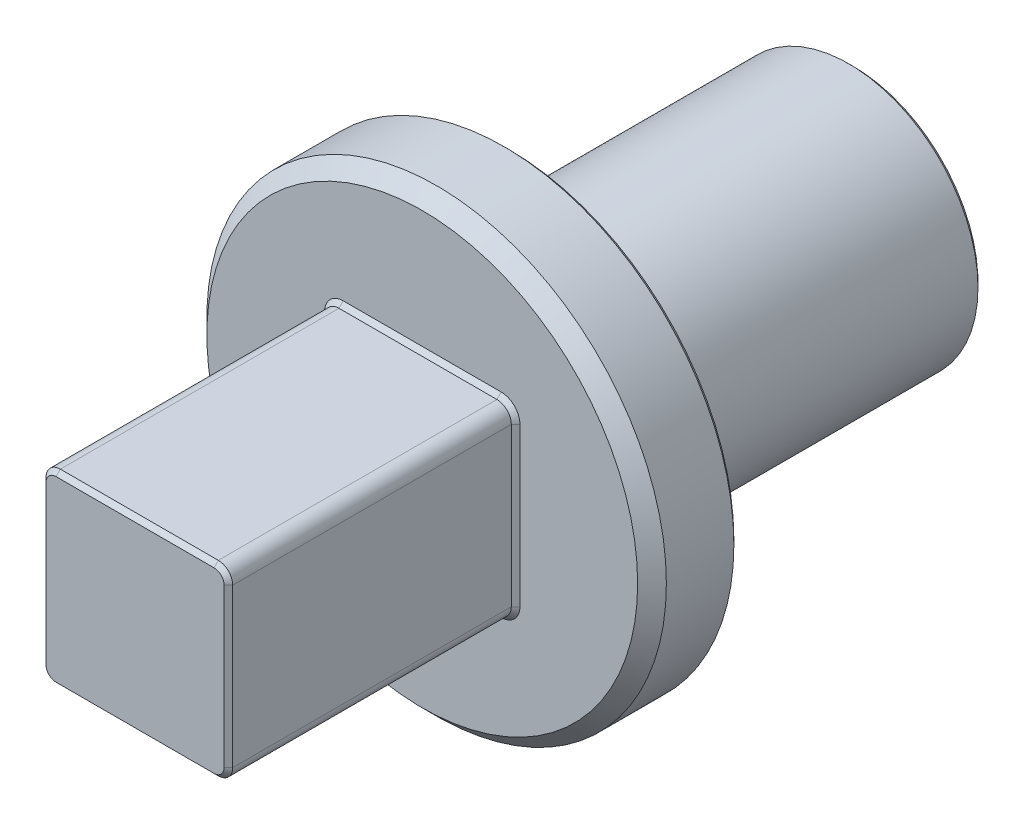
ISO-10303-21;
HEADER;
FILE_DESCRIPTION(('STEP AP214'),'2;1');
FILE_NAME('part.step','',(''),(''),'','','');
FILE_SCHEMA(('AUTOMOTIVE_DESIGN { 1 0 10303 214 1 1 1 1 }'));
ENDSEC;
DATA;
#1=APPLICATION_CONTEXT('core data for automotive mechanical design processes');
#2=APPLICATION_PROTOCOL_DEFINITION('international standard','automotive_design',2000,#1);
#3=PRODUCT_CONTEXT('',#1,'mechanical');
#4=PRODUCT('Part','Part','',(#3));
#5=PRODUCT_RELATED_PRODUCT_CATEGORY('part','',(#4));
#6=PRODUCT_DEFINITION_FORMATION('','',#4);
#7=PRODUCT_DEFINITION_CONTEXT('part definition',#1,'design');
#8=PRODUCT_DEFINITION('design','',#6,#7);
#9=PRODUCT_DEFINITION_SHAPE('','',#8);
#10=(LENGTH_UNIT() NAMED_UNIT(*) SI_UNIT(.MILLI.,.METRE.));
#11=(NAMED_UNIT(*) PLANE_ANGLE_UNIT() SI_UNIT($,.RADIAN.));
#12=(NAMED_UNIT(*) SI_UNIT($,.STERADIAN.) SOLID_ANGLE_UNIT());
#13=UNCERTAINTY_MEASURE_WITH_UNIT(LENGTH_MEASURE(1.E-05),#10,'distance_accuracy_value','');
#14=(GEOMETRIC_REPRESENTATION_CONTEXT(3) GLOBAL_UNCERTAINTY_ASSIGNED_CONTEXT((#13)) GLOBAL_UNIT_ASSIGNED_CONTEXT((#10,
#11,#12)) REPRESENTATION_CONTEXT('',''));
#15=CARTESIAN_POINT('',(0.,0.,0.));
#16=DIRECTION('',(0.,0.,1.));
#17=DIRECTION('',(1.,0.,0.));
#18=AXIS2_PLACEMENT_3D('',#15,#16,#17);
#19=CARTESIAN_POINT('',(0.,0.,0.));
#20=DIRECTION('',(0.,0.,1.));
#21=DIRECTION('',(1.,0.,0.));
#22=AXIS2_PLACEMENT_3D('',#19,#20,#21);
#23=PLANE('',#22);
#24=CARTESIAN_POINT('',(0.,0.,0.));
#25=DIRECTION('',(0.,0.,1.));
#26=DIRECTION('',(1.,0.,0.));
#27=AXIS2_PLACEMENT_3D('',#24,#25,#26);
#28=CIRCLE('',#27,4.65);
#29=CARTESIAN_POINT('',(4.65,0.,0.));
#30=VERTEX_POINT('',#29);
#31=EDGE_CURVE('E220',#30,#30,#28,.T.);
#32=ORIENTED_EDGE('',*,*,#31,.T.);
#33=EDGE_LOOP('',(#32));
#34=FACE_BOUND('',#33,.T.);
#35=CARTESIAN_POINT('',(0.,0.,0.));
#36=DIRECTION('',(0.,0.,1.));
#37=DIRECTION('',(1.,0.,0.));
#38=AXIS2_PLACEMENT_3D('',#35,#36,#37);
#39=CIRCLE('',#38,7.85);
#40=CARTESIAN_POINT('',(7.85,0.,0.));
#41=VERTEX_POINT('',#40);
#42=EDGE_CURVE('E217',#41,#41,#39,.F.);
#43=ORIENTED_EDGE('',*,*,#42,.T.);
#44=EDGE_LOOP('',(#43));
#45=FACE_BOUND('',#44,.T.);
#46=ADVANCED_FACE('F31',(#34,#45),#23,.F.);
#47=CARTESIAN_POINT('',(0.,0.,3.));
#48=DIRECTION('',(0.,0.,1.));
#49=DIRECTION('',(1.,0.,0.));
#50=AXIS2_PLACEMENT_3D('',#47,#48,#49);
#51=PLANE('',#50);
#52=CARTESIAN_POINT('',(-2.75,-2.75,3.));
#53=DIRECTION('',(0.,0.,1.));
#54=DIRECTION('',(1.,0.,0.));
#55=AXIS2_PLACEMENT_3D('',#52,#53,#54);
#56=CIRCLE('',#55,0.65);
#57=CARTESIAN_POINT('',(-2.75,-3.4,3.));
#58=VERTEX_POINT('',#57);
#59=CARTESIAN_POINT('',(-3.4,-2.75,3.));
#60=VERTEX_POINT('',#59);
#61=EDGE_CURVE('E48',#58,#60,#56,.F.);
#62=ORIENTED_EDGE('',*,*,#61,.T.);
#63=DIRECTION('',(0.,1.,0.));
#64=VECTOR('',#63,1.);
#65=CARTESIAN_POINT('',(-3.4,0.,3.));
#66=LINE('',#65,#64);
#67=CARTESIAN_POINT('',(-3.4,2.75,3.));
#68=VERTEX_POINT('',#67);
#69=EDGE_CURVE('E40',#60,#68,#66,.T.);
#70=ORIENTED_EDGE('',*,*,#69,.T.);
#71=CARTESIAN_POINT('',(-2.75,2.75,3.));
#72=DIRECTION('',(0.,0.,1.));
#73=DIRECTION('',(1.,0.,0.));
#74=AXIS2_PLACEMENT_3D('',#71,#72,#73);
#75=CIRCLE('',#74,0.65);
#76=CARTESIAN_POINT('',(-2.75,3.4,3.));
#77=VERTEX_POINT('',#76);
#78=EDGE_CURVE('E236',#68,#77,#75,.F.);
#79=ORIENTED_EDGE('',*,*,#78,.T.);
#80=DIRECTION('',(1.,0.,0.));
#81=VECTOR('',#80,1.);
#82=CARTESIAN_POINT('',(0.,3.4,3.));
#83=LINE('',#82,#81);
#84=CARTESIAN_POINT('',(2.75,3.4,3.));
#85=VERTEX_POINT('',#84);
#86=EDGE_CURVE('E232',#77,#85,#83,.T.);
#87=ORIENTED_EDGE('',*,*,#86,.T.);
#88=CARTESIAN_POINT('',(2.75,2.75,3.));
#89=DIRECTION('',(0.,0.,1.));
#90=DIRECTION('',(1.,0.,0.));
#91=AXIS2_PLACEMENT_3D('',#88,#89,#90);
#92=CIRCLE('',#91,0.65);
#93=CARTESIAN_POINT('',(3.4,2.75,3.));
#94=VERTEX_POINT('',#93);
#95=EDGE_CURVE('E228',#85,#94,#92,.F.);
#96=ORIENTED_EDGE('',*,*,#95,.T.);
#97=DIRECTION('',(0.,-1.,0.));
#98=VECTOR('',#97,1.);
#99=CARTESIAN_POINT('',(3.4,0.,3.));
#100=LINE('',#99,#98);
#101=CARTESIAN_POINT('',(3.4,-2.75,3.));
#102=VERTEX_POINT('',#101);
#103=EDGE_CURVE('E226',#94,#102,#100,.T.);
#104=ORIENTED_EDGE('',*,*,#103,.T.);
#105=CARTESIAN_POINT('',(2.75,-2.75,3.));
#106=DIRECTION('',(0.,0.,1.));
#107=DIRECTION('',(1.,0.,0.));
#108=AXIS2_PLACEMENT_3D('',#105,#106,#107);
#109=CIRCLE('',#108,0.65);
#110=CARTESIAN_POINT('',(2.75,-3.4,3.));
#111=VERTEX_POINT('',#110);
#112=EDGE_CURVE('E230',#102,#111,#109,.F.);
#113=ORIENTED_EDGE('',*,*,#112,.T.);
#114=DIRECTION('',(-1.,0.,0.));
#115=VECTOR('',#114,1.);
#116=CARTESIAN_POINT('',(0.,-3.4,3.));
#117=LINE('',#116,#115);
#118=EDGE_CURVE('E234',#111,#58,#117,.T.);
#119=ORIENTED_EDGE('',*,*,#118,.T.);
#120=EDGE_LOOP('',(#62,#70,#79,#87,#96,#104,#113,#119));
#121=FACE_BOUND('',#120,.T.);
#122=CARTESIAN_POINT('',(0.,0.,3.));
#123=DIRECTION('',(0.,0.,1.));
#124=DIRECTION('',(1.,0.,0.));
#125=AXIS2_PLACEMENT_3D('',#122,#123,#124);
#126=CIRCLE('',#125,7.5);
#127=CARTESIAN_POINT('',(7.5,0.,3.));
#128=VERTEX_POINT('',#127);
#129=EDGE_CURVE('E257',#128,#128,#126,.T.);
#130=ORIENTED_EDGE('',*,*,#129,.T.);
#131=EDGE_LOOP('',(#130));
#132=FACE_BOUND('',#131,.T.);
#133=ADVANCED_FACE('F289',(#121,#132),#51,.T.);
#134=CARTESIAN_POINT('',(0.,0.,3.));
#135=DIRECTION('',(0.,0.,-1.));
#136=DIRECTION('',(-1.,0.,0.));
#137=AXIS2_PLACEMENT_3D('',#134,#135,#136);
#138=CYLINDRICAL_SURFACE('',#137,8.);
#139=CARTESIAN_POINT('',(0.,0.,0.149999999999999));
#140=DIRECTION('',(0.,0.,1.));
#141=DIRECTION('',(1.,0.,0.));
#142=AXIS2_PLACEMENT_3D('',#139,#140,#141);
#143=CIRCLE('',#142,8.);
#144=CARTESIAN_POINT('',(8.,0.,0.149999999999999));
#145=VERTEX_POINT('',#144);
#146=EDGE_CURVE('E11',#145,#145,#143,.T.);
#147=ORIENTED_EDGE('',*,*,#146,.T.);
#148=EDGE_LOOP('',(#147));
#149=FACE_BOUND('',#148,.T.);
#150=CARTESIAN_POINT('',(0.,0.,2.49999999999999));
#151=DIRECTION('',(0.,0.,1.));
#152=DIRECTION('',(1.,0.,0.));
#153=AXIS2_PLACEMENT_3D('',#150,#151,#152);
#154=CIRCLE('',#153,8.);
#155=CARTESIAN_POINT('',(8.,0.,2.49999999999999));
#156=VERTEX_POINT('',#155);
#157=EDGE_CURVE('E373',#156,#156,#154,.F.);
#158=ORIENTED_EDGE('',*,*,#157,.T.);
#159=EDGE_LOOP('',(#158));
#160=FACE_BOUND('',#159,.T.);
#161=ADVANCED_FACE('F403',(#149,#160),#138,.T.);
#162=CARTESIAN_POINT('',(-3.25,3.25,13.));
#163=DIRECTION('',(1.,0.,0.));
#164=DIRECTION('',(0.,1.,0.));
#165=AXIS2_PLACEMENT_3D('',#162,#163,#164);
#166=PLANE('',#165);
#167=DIRECTION('',(0.,0.,-1.));
#168=VECTOR('',#167,1.);
#169=CARTESIAN_POINT('',(-3.25,-2.75,13.));
#170=LINE('',#169,#168);
#171=CARTESIAN_POINT('',(-3.25,-2.75,3.15));
#172=VERTEX_POINT('',#171);
#173=CARTESIAN_POINT('',(-3.25,-2.75,12.85));
#174=VERTEX_POINT('',#173);
#175=EDGE_CURVE('E311',#172,#174,#170,.F.);
#176=ORIENTED_EDGE('',*,*,#175,.T.);
#177=DIRECTION('',(0.,1.,0.));
#178=VECTOR('',#177,1.);
#179=CARTESIAN_POINT('',(-3.25,3.25,12.85));
#180=LINE('',#179,#178);
#181=CARTESIAN_POINT('',(-3.25,2.75,12.85));
#182=VERTEX_POINT('',#181);
#183=EDGE_CURVE('E209',#174,#182,#180,.T.);
#184=ORIENTED_EDGE('',*,*,#183,.T.);
#185=DIRECTION('',(0.,0.,-1.));
#186=VECTOR('',#185,1.);
#187=CARTESIAN_POINT('',(-3.25,2.75,13.));
#188=LINE('',#187,#186);
#189=CARTESIAN_POINT('',(-3.25,2.75,3.15));
#190=VERTEX_POINT('',#189);
#191=EDGE_CURVE('E305',#182,#190,#188,.T.);
#192=ORIENTED_EDGE('',*,*,#191,.T.);
#193=DIRECTION('',(0.,-1.,0.));
#194=VECTOR('',#193,1.);
#195=CARTESIAN_POINT('',(-3.25,3.25,3.15));
#196=LINE('',#195,#194);
#197=EDGE_CURVE('E206',#190,#172,#196,.T.);
#198=ORIENTED_EDGE('',*,*,#197,.T.);
#199=EDGE_LOOP('',(#176,#184,#192,#198));
#200=FACE_BOUND('',#199,.T.);
#201=ADVANCED_FACE('F309',(#200),#166,.F.);
#202=CARTESIAN_POINT('',(3.25,-3.25,13.));
#203=DIRECTION('',(0.,1.,0.));
#204=DIRECTION('',(-1.,0.,0.));
#205=AXIS2_PLACEMENT_3D('',#202,#203,#204);
#206=PLANE('',#205);
#207=DIRECTION('',(0.,0.,-1.));
#208=VECTOR('',#207,1.);
#209=CARTESIAN_POINT('',(2.75,-3.25,13.));
#210=LINE('',#209,#208);
#211=CARTESIAN_POINT('',(2.75,-3.25,3.15));
#212=VERTEX_POINT('',#211);
#213=CARTESIAN_POINT('',(2.75,-3.25,12.85));
#214=VERTEX_POINT('',#213);
#215=EDGE_CURVE('E317',#212,#214,#210,.F.);
#216=ORIENTED_EDGE('',*,*,#215,.T.);
#217=DIRECTION('',(-1.,0.,0.));
#218=VECTOR('',#217,1.);
#219=CARTESIAN_POINT('',(3.25,-3.25,12.85));
#220=LINE('',#219,#218);
#221=CARTESIAN_POINT('',(-2.75,-3.25,12.85));
#222=VERTEX_POINT('',#221);
#223=EDGE_CURVE('E200',#214,#222,#220,.T.);
#224=ORIENTED_EDGE('',*,*,#223,.T.);
#225=DIRECTION('',(0.,0.,-1.));
#226=VECTOR('',#225,1.);
#227=CARTESIAN_POINT('',(-2.75,-3.25,13.));
#228=LINE('',#227,#226);
#229=CARTESIAN_POINT('',(-2.75,-3.25,3.15));
#230=VERTEX_POINT('',#229);
#231=EDGE_CURVE('E312',#222,#230,#228,.T.);
#232=ORIENTED_EDGE('',*,*,#231,.T.);
#233=DIRECTION('',(1.,0.,0.));
#234=VECTOR('',#233,1.);
#235=CARTESIAN_POINT('',(3.25,-3.25,3.15));
#236=LINE('',#235,#234);
#237=EDGE_CURVE('E198',#230,#212,#236,.T.);
#238=ORIENTED_EDGE('',*,*,#237,.T.);
#239=EDGE_LOOP('',(#216,#224,#232,#238));
#240=FACE_BOUND('',#239,.T.);
#241=ADVANCED_FACE('F370',(#240),#206,.F.);
#242=CARTESIAN_POINT('',(3.25,3.25,13.));
#243=DIRECTION('',(-1.,0.,0.));
#244=DIRECTION('',(0.,-1.,0.));
#245=AXIS2_PLACEMENT_3D('',#242,#243,#244);
#246=PLANE('',#245);
#247=DIRECTION('',(0.,0.,-1.));
#248=VECTOR('',#247,1.);
#249=CARTESIAN_POINT('',(3.25,2.75,13.));
#250=LINE('',#249,#248);
#251=CARTESIAN_POINT('',(3.25,2.75,3.15));
#252=VERTEX_POINT('',#251);
#253=CARTESIAN_POINT('',(3.25,2.75,12.85));
#254=VERTEX_POINT('',#253);
#255=EDGE_CURVE('E314',#252,#254,#250,.F.);
#256=ORIENTED_EDGE('',*,*,#255,.T.);
#257=DIRECTION('',(0.,-1.,0.));
#258=VECTOR('',#257,1.);
#259=CARTESIAN_POINT('',(3.25,3.25,12.85));
#260=LINE('',#259,#258);
#261=CARTESIAN_POINT('',(3.25,-2.75,12.85));
#262=VERTEX_POINT('',#261);
#263=EDGE_CURVE('E192',#254,#262,#260,.T.);
#264=ORIENTED_EDGE('',*,*,#263,.T.);
#265=DIRECTION('',(0.,0.,-1.));
#266=VECTOR('',#265,1.);
#267=CARTESIAN_POINT('',(3.25,-2.75,13.));
#268=LINE('',#267,#266);
#269=CARTESIAN_POINT('',(3.25,-2.75,3.15));
#270=VERTEX_POINT('',#269);
#271=EDGE_CURVE('E323',#262,#270,#268,.T.);
#272=ORIENTED_EDGE('',*,*,#271,.T.);
#273=DIRECTION('',(0.,1.,0.));
#274=VECTOR('',#273,1.);
#275=CARTESIAN_POINT('',(3.25,3.25,3.15));
#276=LINE('',#275,#274);
#277=EDGE_CURVE('E190',#270,#252,#276,.T.);
#278=ORIENTED_EDGE('',*,*,#277,.T.);
#279=EDGE_LOOP('',(#256,#264,#272,#278));
#280=FACE_BOUND('',#279,.T.);
#281=ADVANCED_FACE('F354',(#280),#246,.F.);
#282=CARTESIAN_POINT('',(3.25,3.25,13.));
#283=DIRECTION('',(0.,-1.,0.));
#284=DIRECTION('',(1.,0.,0.));
#285=AXIS2_PLACEMENT_3D('',#282,#283,#284);
#286=PLANE('',#285);
#287=DIRECTION('',(0.,0.,-1.));
#288=VECTOR('',#287,1.);
#289=CARTESIAN_POINT('',(-2.75,3.25,13.));
#290=LINE('',#289,#288);
#291=CARTESIAN_POINT('',(-2.75,3.25,3.15));
#292=VERTEX_POINT('',#291);
#293=CARTESIAN_POINT('',(-2.75,3.25,12.85));
#294=VERTEX_POINT('',#293);
#295=EDGE_CURVE('E168',#292,#294,#290,.F.);
#296=ORIENTED_EDGE('',*,*,#295,.T.);
#297=DIRECTION('',(1.,0.,0.));
#298=VECTOR('',#297,1.);
#299=CARTESIAN_POINT('',(3.25,3.25,12.85));
#300=LINE('',#299,#298);
#301=CARTESIAN_POINT('',(2.75,3.25,12.85));
#302=VERTEX_POINT('',#301);
#303=EDGE_CURVE('E184',#294,#302,#300,.T.);
#304=ORIENTED_EDGE('',*,*,#303,.T.);
#305=DIRECTION('',(0.,0.,-1.));
#306=VECTOR('',#305,1.);
#307=CARTESIAN_POINT('',(2.75,3.25,13.));
#308=LINE('',#307,#306);
#309=CARTESIAN_POINT('',(2.75,3.25,3.15));
#310=VERTEX_POINT('',#309);
#311=EDGE_CURVE('E326',#302,#310,#308,.T.);
#312=ORIENTED_EDGE('',*,*,#311,.T.);
#313=DIRECTION('',(-1.,0.,0.));
#314=VECTOR('',#313,1.);
#315=CARTESIAN_POINT('',(3.25,3.25,3.15));
#316=LINE('',#315,#314);
#317=EDGE_CURVE('E182',#310,#292,#316,.T.);
#318=ORIENTED_EDGE('',*,*,#317,.T.);
#319=EDGE_LOOP('',(#296,#304,#312,#318));
#320=FACE_BOUND('',#319,.T.);
#321=ADVANCED_FACE('F348',(#320),#286,.F.);
#322=CARTESIAN_POINT('',(-3.25,-3.25,13.));
#323=DIRECTION('',(0.,0.,-1.));
#324=DIRECTION('',(-1.,0.,0.));
#325=AXIS2_PLACEMENT_3D('',#322,#323,#324);
#326=PLANE('',#325);
#327=DIRECTION('',(-1.,0.,0.));
#328=VECTOR('',#327,1.);
#329=CARTESIAN_POINT('',(-3.25,3.1,13.));
#330=LINE('',#329,#328);
#331=CARTESIAN_POINT('',(2.75,3.1,13.));
#332=VERTEX_POINT('',#331);
#333=CARTESIAN_POINT('',(-2.75,3.1,13.));
#334=VERTEX_POINT('',#333);
#335=EDGE_CURVE('E172',#332,#334,#330,.T.);
#336=ORIENTED_EDGE('',*,*,#335,.T.);
#337=CARTESIAN_POINT('',(-2.75,2.75,13.));
#338=DIRECTION('',(0.,0.,-1.));
#339=DIRECTION('',(-1.,0.,0.));
#340=AXIS2_PLACEMENT_3D('',#337,#338,#339);
#341=CIRCLE('',#340,0.349999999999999);
#342=CARTESIAN_POINT('',(-3.1,2.75,13.));
#343=VERTEX_POINT('',#342);
#344=EDGE_CURVE('E153',#334,#343,#341,.F.);
#345=ORIENTED_EDGE('',*,*,#344,.T.);
#346=DIRECTION('',(0.,-1.,0.));
#347=VECTOR('',#346,1.);
#348=CARTESIAN_POINT('',(-3.1,-3.25,13.));
#349=LINE('',#348,#347);
#350=CARTESIAN_POINT('',(-3.1,-2.75,13.));
#351=VERTEX_POINT('',#350);
#352=EDGE_CURVE('E161',#343,#351,#349,.T.);
#353=ORIENTED_EDGE('',*,*,#352,.T.);
#354=CARTESIAN_POINT('',(-2.75,-2.75,13.));
#355=DIRECTION('',(0.,0.,-1.));
#356=DIRECTION('',(-1.,0.,0.));
#357=AXIS2_PLACEMENT_3D('',#354,#355,#356);
#358=CIRCLE('',#357,0.349999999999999);
#359=CARTESIAN_POINT('',(-2.75,-3.1,13.));
#360=VERTEX_POINT('',#359);
#361=EDGE_CURVE('E167',#351,#360,#358,.F.);
#362=ORIENTED_EDGE('',*,*,#361,.T.);
#363=DIRECTION('',(1.,0.,0.));
#364=VECTOR('',#363,1.);
#365=CARTESIAN_POINT('',(-3.25,-3.1,13.));
#366=LINE('',#365,#364);
#367=CARTESIAN_POINT('',(2.75,-3.1,13.));
#368=VERTEX_POINT('',#367);
#369=EDGE_CURVE('E331',#360,#368,#366,.T.);
#370=ORIENTED_EDGE('',*,*,#369,.T.);
#371=CARTESIAN_POINT('',(2.75,-2.75,13.));
#372=DIRECTION('',(0.,0.,-1.));
#373=DIRECTION('',(-1.,0.,0.));
#374=AXIS2_PLACEMENT_3D('',#371,#372,#373);
#375=CIRCLE('',#374,0.349999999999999);
#376=CARTESIAN_POINT('',(3.1,-2.75,13.));
#377=VERTEX_POINT('',#376);
#378=EDGE_CURVE('E333',#368,#377,#375,.F.);
#379=ORIENTED_EDGE('',*,*,#378,.T.);
#380=DIRECTION('',(0.,1.,0.));
#381=VECTOR('',#380,1.);
#382=CARTESIAN_POINT('',(3.1,-3.25,13.));
#383=LINE('',#382,#381);
#384=CARTESIAN_POINT('',(3.1,2.75,13.));
#385=VERTEX_POINT('',#384);
#386=EDGE_CURVE('E335',#377,#385,#383,.T.);
#387=ORIENTED_EDGE('',*,*,#386,.T.);
#388=CARTESIAN_POINT('',(2.75,2.75,13.));
#389=DIRECTION('',(0.,0.,-1.));
#390=DIRECTION('',(-1.,0.,0.));
#391=AXIS2_PLACEMENT_3D('',#388,#389,#390);
#392=CIRCLE('',#391,0.349999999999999);
#393=EDGE_CURVE('E177',#385,#332,#392,.F.);
#394=ORIENTED_EDGE('',*,*,#393,.T.);
#395=EDGE_LOOP('',(#336,#345,#353,#362,#370,#379,#387,#394));
#396=FACE_BOUND('',#395,.T.);
#397=ADVANCED_FACE('F170',(#396),#326,.F.);
#398=CARTESIAN_POINT('',(0.,0.,-12.));
#399=DIRECTION('',(0.,0.,1.));
#400=DIRECTION('',(1.,0.,0.));
#401=AXIS2_PLACEMENT_3D('',#398,#399,#400);
#402=CYLINDRICAL_SURFACE('',#401,4.5);
#403=CARTESIAN_POINT('',(0.,0.,-0.150000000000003));
#404=DIRECTION('',(0.,0.,1.));
#405=DIRECTION('',(1.,0.,0.));
#406=AXIS2_PLACEMENT_3D('',#403,#404,#405);
#407=CIRCLE('',#406,4.5);
#408=CARTESIAN_POINT('',(4.5,0.,-0.150000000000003));
#409=VERTEX_POINT('',#408);
#410=EDGE_CURVE('E214',#409,#409,#407,.F.);
#411=ORIENTED_EDGE('',*,*,#410,.T.);
#412=EDGE_LOOP('',(#411));
#413=FACE_BOUND('',#412,.T.);
#414=CARTESIAN_POINT('',(0.,0.,-11.85));
#415=DIRECTION('',(0.,0.,-1.));
#416=DIRECTION('',(-1.,0.,0.));
#417=AXIS2_PLACEMENT_3D('',#414,#415,#416);
#418=CIRCLE('',#417,4.5);
#419=CARTESIAN_POINT('',(-4.5,0.,-11.85));
#420=VERTEX_POINT('',#419);
#421=EDGE_CURVE('E211',#420,#420,#418,.F.);
#422=ORIENTED_EDGE('',*,*,#421,.T.);
#423=EDGE_LOOP('',(#422));
#424=FACE_BOUND('',#423,.T.);
#425=ADVANCED_FACE('F392',(#413,#424),#402,.T.);
#426=CARTESIAN_POINT('',(0.,0.,-12.));
#427=DIRECTION('',(0.,0.,-1.));
#428=DIRECTION('',(-1.,0.,0.));
#429=AXIS2_PLACEMENT_3D('',#426,#427,#428);
#430=PLANE('',#429);
#431=CARTESIAN_POINT('',(0.,0.,-12.));
#432=DIRECTION('',(0.,0.,-1.));
#433=DIRECTION('',(-1.,0.,0.));
#434=AXIS2_PLACEMENT_3D('',#431,#432,#433);
#435=CIRCLE('',#434,4.35);
#436=CARTESIAN_POINT('',(-4.35,0.,-12.));
#437=VERTEX_POINT('',#436);
#438=EDGE_CURVE('E223',#437,#437,#435,.T.);
#439=ORIENTED_EDGE('',*,*,#438,.T.);
#440=EDGE_LOOP('',(#439));
#441=FACE_BOUND('',#440,.T.);
#442=ADVANCED_FACE('F383',(#441),#430,.T.);
#443=CARTESIAN_POINT('',(0.,0.,3.));
#444=DIRECTION('',(0.,0.,-1.));
#445=DIRECTION('',(-1.,0.,0.));
#446=AXIS2_PLACEMENT_3D('',#443,#444,#445);
#447=CONICAL_SURFACE('',#446,7.5,0.785398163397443);
#448=ORIENTED_EDGE('',*,*,#157,.F.);
#449=EDGE_LOOP('',(#448));
#450=FACE_BOUND('',#449,.T.);
#451=ORIENTED_EDGE('',*,*,#129,.F.);
#452=EDGE_LOOP('',(#451));
#453=FACE_BOUND('',#452,.T.);
#454=ADVANCED_FACE('F380',(#450,#453),#447,.T.);
#455=CARTESIAN_POINT('',(-2.75,-2.75,13.));
#456=DIRECTION('',(0.,0.,-1.));
#457=DIRECTION('',(-1.,0.,0.));
#458=AXIS2_PLACEMENT_3D('',#455,#456,#457);
#459=CYLINDRICAL_SURFACE('',#458,0.5);
#460=ORIENTED_EDGE('',*,*,#231,.F.);
#461=CARTESIAN_POINT('',(-2.75,-2.75,12.85));
#462=DIRECTION('',(0.,0.,-1.));
#463=DIRECTION('',(-1.,0.,0.));
#464=AXIS2_PLACEMENT_3D('',#461,#462,#463);
#465=CIRCLE('',#464,0.5);
#466=EDGE_CURVE('E204',#222,#174,#465,.T.);
#467=ORIENTED_EDGE('',*,*,#466,.T.);
#468=ORIENTED_EDGE('',*,*,#175,.F.);
#469=CARTESIAN_POINT('',(-2.75,-2.75,3.15));
#470=DIRECTION('',(0.,0.,1.));
#471=DIRECTION('',(1.,0.,0.));
#472=AXIS2_PLACEMENT_3D('',#469,#470,#471);
#473=CIRCLE('',#472,0.5);
#474=EDGE_CURVE('E202',#172,#230,#473,.T.);
#475=ORIENTED_EDGE('',*,*,#474,.T.);
#476=EDGE_LOOP('',(#460,#467,#468,#475));
#477=FACE_BOUND('',#476,.T.);
#478=ADVANCED_FACE('F382',(#477),#459,.T.);
#479=CARTESIAN_POINT('',(2.75,-2.75,13.));
#480=DIRECTION('',(0.,0.,-1.));
#481=DIRECTION('',(-1.,0.,0.));
#482=AXIS2_PLACEMENT_3D('',#479,#480,#481);
#483=CYLINDRICAL_SURFACE('',#482,0.5);
#484=ORIENTED_EDGE('',*,*,#271,.F.);
#485=CARTESIAN_POINT('',(2.75,-2.75,12.85));
#486=DIRECTION('',(0.,0.,-1.));
#487=DIRECTION('',(-1.,0.,0.));
#488=AXIS2_PLACEMENT_3D('',#485,#486,#487);
#489=CIRCLE('',#488,0.5);
#490=EDGE_CURVE('E196',#262,#214,#489,.T.);
#491=ORIENTED_EDGE('',*,*,#490,.T.);
#492=ORIENTED_EDGE('',*,*,#215,.F.);
#493=CARTESIAN_POINT('',(2.75,-2.75,3.15));
#494=DIRECTION('',(0.,0.,1.));
#495=DIRECTION('',(1.,0.,0.));
#496=AXIS2_PLACEMENT_3D('',#493,#494,#495);
#497=CIRCLE('',#496,0.5);
#498=EDGE_CURVE('E194',#212,#270,#497,.T.);
#499=ORIENTED_EDGE('',*,*,#498,.T.);
#500=EDGE_LOOP('',(#484,#491,#492,#499));
#501=FACE_BOUND('',#500,.T.);
#502=ADVANCED_FACE('F368',(#501),#483,.T.);
#503=CARTESIAN_POINT('',(-2.75,2.75,13.));
#504=DIRECTION('',(0.,0.,-1.));
#505=DIRECTION('',(-1.,0.,0.));
#506=AXIS2_PLACEMENT_3D('',#503,#504,#505);
#507=CYLINDRICAL_SURFACE('',#506,0.5);
#508=ORIENTED_EDGE('',*,*,#191,.F.);
#509=CARTESIAN_POINT('',(-2.75,2.75,12.85));
#510=DIRECTION('',(0.,0.,-1.));
#511=DIRECTION('',(-1.,0.,0.));
#512=AXIS2_PLACEMENT_3D('',#509,#510,#511);
#513=CIRCLE('',#512,0.5);
#514=EDGE_CURVE('E155',#182,#294,#513,.T.);
#515=ORIENTED_EDGE('',*,*,#514,.T.);
#516=ORIENTED_EDGE('',*,*,#295,.F.);
#517=CARTESIAN_POINT('',(-2.75,2.75,3.15));
#518=DIRECTION('',(0.,0.,1.));
#519=DIRECTION('',(1.,0.,0.));
#520=AXIS2_PLACEMENT_3D('',#517,#518,#519);
#521=CIRCLE('',#520,0.5);
#522=EDGE_CURVE('E174',#292,#190,#521,.T.);
#523=ORIENTED_EDGE('',*,*,#522,.T.);
#524=EDGE_LOOP('',(#508,#515,#516,#523));
#525=FACE_BOUND('',#524,.T.);
#526=ADVANCED_FACE('F304',(#525),#507,.T.);
#527=CARTESIAN_POINT('',(2.75,2.75,13.));
#528=DIRECTION('',(0.,0.,-1.));
#529=DIRECTION('',(-1.,0.,0.));
#530=AXIS2_PLACEMENT_3D('',#527,#528,#529);
#531=CYLINDRICAL_SURFACE('',#530,0.5);
#532=ORIENTED_EDGE('',*,*,#311,.F.);
#533=CARTESIAN_POINT('',(2.75,2.75,12.85));
#534=DIRECTION('',(0.,0.,-1.));
#535=DIRECTION('',(-1.,0.,0.));
#536=AXIS2_PLACEMENT_3D('',#533,#534,#535);
#537=CIRCLE('',#536,0.5);
#538=EDGE_CURVE('E188',#302,#254,#537,.T.);
#539=ORIENTED_EDGE('',*,*,#538,.T.);
#540=ORIENTED_EDGE('',*,*,#255,.F.);
#541=CARTESIAN_POINT('',(2.75,2.75,3.15));
#542=DIRECTION('',(0.,0.,1.));
#543=DIRECTION('',(1.,0.,0.));
#544=AXIS2_PLACEMENT_3D('',#541,#542,#543);
#545=CIRCLE('',#544,0.5);
#546=EDGE_CURVE('E186',#252,#310,#545,.T.);
#547=ORIENTED_EDGE('',*,*,#546,.T.);
#548=EDGE_LOOP('',(#532,#539,#540,#547));
#549=FACE_BOUND('',#548,.T.);
#550=ADVANCED_FACE('F350',(#549),#531,.T.);
#551=CARTESIAN_POINT('',(2.75,-2.75,13.));
#552=DIRECTION('',(0.,0.,-1.));
#553=DIRECTION('',(-1.,0.,0.));
#554=AXIS2_PLACEMENT_3D('',#551,#552,#553);
#555=CONICAL_SURFACE('',#554,0.349999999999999,0.785398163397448);
#556=DIRECTION('',(0.,0.707106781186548,0.707106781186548));
#557=VECTOR('',#556,1.);
#558=CARTESIAN_POINT('',(2.75,-3.25,12.85));
#559=LINE('',#558,#557);
#560=EDGE_CURVE('E251',#214,#368,#559,.T.);
#561=ORIENTED_EDGE('',*,*,#560,.F.);
#562=ORIENTED_EDGE('',*,*,#490,.F.);
#563=DIRECTION('',(0.707106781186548,0.,-0.707106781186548));
#564=VECTOR('',#563,1.);
#565=CARTESIAN_POINT('',(3.1,-2.75,13.));
#566=LINE('',#565,#564);
#567=EDGE_CURVE('E254',#377,#262,#566,.T.);
#568=ORIENTED_EDGE('',*,*,#567,.F.);
#569=ORIENTED_EDGE('',*,*,#378,.F.);
#570=EDGE_LOOP('',(#561,#562,#568,#569));
#571=FACE_BOUND('',#570,.T.);
#572=ADVANCED_FACE('F363',(#571),#555,.T.);
#573=CARTESIAN_POINT('',(3.1,-3.25,13.));
#574=DIRECTION('',(-0.70710678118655,0.,-0.707106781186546));
#575=DIRECTION('',(-0.707106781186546,0.,0.70710678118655));
#576=AXIS2_PLACEMENT_3D('',#573,#574,#575);
#577=PLANE('',#576);
#578=ORIENTED_EDGE('',*,*,#567,.T.);
#579=ORIENTED_EDGE('',*,*,#263,.F.);
#580=DIRECTION('',(0.707106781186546,0.,-0.70710678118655));
#581=VECTOR('',#580,1.);
#582=CARTESIAN_POINT('',(3.1,2.75,13.));
#583=LINE('',#582,#581);
#584=EDGE_CURVE('E248',#385,#254,#583,.T.);
#585=ORIENTED_EDGE('',*,*,#584,.F.);
#586=ORIENTED_EDGE('',*,*,#386,.F.);
#587=EDGE_LOOP('',(#578,#579,#585,#586));
#588=FACE_BOUND('',#587,.T.);
#589=ADVANCED_FACE('F357',(#588),#577,.F.);
#590=CARTESIAN_POINT('',(-3.25,-3.1,13.));
#591=DIRECTION('',(0.,0.707106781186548,-0.707106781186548));
#592=DIRECTION('',(0.,0.707106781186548,0.707106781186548));
#593=AXIS2_PLACEMENT_3D('',#590,#591,#592);
#594=PLANE('',#593);
#595=ORIENTED_EDGE('',*,*,#560,.T.);
#596=ORIENTED_EDGE('',*,*,#369,.F.);
#597=DIRECTION('',(0.,0.707106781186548,0.707106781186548));
#598=VECTOR('',#597,1.);
#599=CARTESIAN_POINT('',(-2.75,-3.25,12.85));
#600=LINE('',#599,#598);
#601=EDGE_CURVE('E245',#222,#360,#600,.T.);
#602=ORIENTED_EDGE('',*,*,#601,.F.);
#603=ORIENTED_EDGE('',*,*,#223,.F.);
#604=EDGE_LOOP('',(#595,#596,#602,#603));
#605=FACE_BOUND('',#604,.T.);
#606=ADVANCED_FACE('F547',(#605),#594,.F.);
#607=CARTESIAN_POINT('',(2.75,2.75,13.));
#608=DIRECTION('',(0.,0.,-1.));
#609=DIRECTION('',(-1.,0.,0.));
#610=AXIS2_PLACEMENT_3D('',#607,#608,#609);
#611=CONICAL_SURFACE('',#610,0.349999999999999,0.785398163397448);
#612=ORIENTED_EDGE('',*,*,#584,.T.);
#613=ORIENTED_EDGE('',*,*,#538,.F.);
#614=DIRECTION('',(0.,0.707106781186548,-0.707106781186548));
#615=VECTOR('',#614,1.);
#616=CARTESIAN_POINT('',(2.75,3.1,13.));
#617=LINE('',#616,#615);
#618=EDGE_CURVE('E242',#332,#302,#617,.T.);
#619=ORIENTED_EDGE('',*,*,#618,.F.);
#620=ORIENTED_EDGE('',*,*,#393,.F.);
#621=EDGE_LOOP('',(#612,#613,#619,#620));
#622=FACE_BOUND('',#621,.T.);
#623=ADVANCED_FACE('F342',(#622),#611,.T.);
#624=CARTESIAN_POINT('',(-2.75,-2.75,13.));
#625=DIRECTION('',(0.,0.,-1.));
#626=DIRECTION('',(-1.,0.,0.));
#627=AXIS2_PLACEMENT_3D('',#624,#625,#626);
#628=CONICAL_SURFACE('',#627,0.349999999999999,0.785398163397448);
#629=ORIENTED_EDGE('',*,*,#601,.T.);
#630=ORIENTED_EDGE('',*,*,#361,.F.);
#631=DIRECTION('',(0.707106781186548,0.,0.707106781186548));
#632=VECTOR('',#631,1.);
#633=CARTESIAN_POINT('',(-3.25,-2.75,12.85));
#634=LINE('',#633,#632);
#635=EDGE_CURVE('E164',#174,#351,#634,.T.);
#636=ORIENTED_EDGE('',*,*,#635,.F.);
#637=ORIENTED_EDGE('',*,*,#466,.F.);
#638=EDGE_LOOP('',(#629,#630,#636,#637));
#639=FACE_BOUND('',#638,.T.);
#640=ADVANCED_FACE('F565',(#639),#628,.T.);
#641=CARTESIAN_POINT('',(-3.25,3.1,13.));
#642=DIRECTION('',(0.,-0.707106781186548,-0.707106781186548));
#643=DIRECTION('',(0.,0.707106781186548,-0.707106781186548));
#644=AXIS2_PLACEMENT_3D('',#641,#642,#643);
#645=PLANE('',#644);
#646=ORIENTED_EDGE('',*,*,#618,.T.);
#647=ORIENTED_EDGE('',*,*,#303,.F.);
#648=DIRECTION('',(0.,0.707106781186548,-0.707106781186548));
#649=VECTOR('',#648,1.);
#650=CARTESIAN_POINT('',(-2.75,3.1,13.));
#651=LINE('',#650,#649);
#652=EDGE_CURVE('E158',#334,#294,#651,.T.);
#653=ORIENTED_EDGE('',*,*,#652,.F.);
#654=ORIENTED_EDGE('',*,*,#335,.F.);
#655=EDGE_LOOP('',(#646,#647,#653,#654));
#656=FACE_BOUND('',#655,.T.);
#657=ADVANCED_FACE('F345',(#656),#645,.F.);
#658=CARTESIAN_POINT('',(-3.1,-3.25,13.));
#659=DIRECTION('',(0.707106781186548,0.,-0.707106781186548));
#660=DIRECTION('',(-0.707106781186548,0.,-0.707106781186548));
#661=AXIS2_PLACEMENT_3D('',#658,#659,#660);
#662=PLANE('',#661);
#663=ORIENTED_EDGE('',*,*,#635,.T.);
#664=ORIENTED_EDGE('',*,*,#352,.F.);
#665=DIRECTION('',(0.707106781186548,0.,0.707106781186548));
#666=VECTOR('',#665,1.);
#667=CARTESIAN_POINT('',(-3.25,2.75,12.85));
#668=LINE('',#667,#666);
#669=EDGE_CURVE('E149',#182,#343,#668,.T.);
#670=ORIENTED_EDGE('',*,*,#669,.F.);
#671=ORIENTED_EDGE('',*,*,#183,.F.);
#672=EDGE_LOOP('',(#663,#664,#670,#671));
#673=FACE_BOUND('',#672,.T.);
#674=ADVANCED_FACE('F162',(#673),#662,.F.);
#675=CARTESIAN_POINT('',(-2.75,2.75,13.));
#676=DIRECTION('',(0.,0.,-1.));
#677=DIRECTION('',(-1.,0.,0.));
#678=AXIS2_PLACEMENT_3D('',#675,#676,#677);
#679=CONICAL_SURFACE('',#678,0.349999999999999,0.785398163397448);
#680=ORIENTED_EDGE('',*,*,#652,.T.);
#681=ORIENTED_EDGE('',*,*,#514,.F.);
#682=ORIENTED_EDGE('',*,*,#669,.T.);
#683=ORIENTED_EDGE('',*,*,#344,.F.);
#684=EDGE_LOOP('',(#680,#681,#682,#683));
#685=FACE_BOUND('',#684,.T.);
#686=ADVANCED_FACE('F151',(#685),#679,.T.);
#687=CARTESIAN_POINT('',(0.,0.,-0.150000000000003));
#688=DIRECTION('',(0.,0.,1.));
#689=DIRECTION('',(1.,0.,0.));
#690=AXIS2_PLACEMENT_3D('',#687,#688,#689);
#691=CONICAL_SURFACE('',#690,4.5,0.785398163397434);
#692=CARTESIAN_POINT('',(4.65,0.,0.));
#693=CARTESIAN_POINT('',(4.6484375,0.,-0.00156249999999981));
#694=CARTESIAN_POINT('',(4.646875,0.,-0.00312499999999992));
#695=CARTESIAN_POINT('',(4.64375,0.,-0.00625000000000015));
#696=CARTESIAN_POINT('',(4.6421875,0.,-0.00781250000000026));
#697=CARTESIAN_POINT('',(4.6390625,0.,-0.0109375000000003));
#698=CARTESIAN_POINT('',(4.6375,0.,-0.0125000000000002));
#699=CARTESIAN_POINT('',(4.634375,0.,-0.0156250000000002));
#700=CARTESIAN_POINT('',(4.6328125,0.,-0.0171875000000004));
#701=CARTESIAN_POINT('',(4.6296875,0.,-0.0203125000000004));
#702=CARTESIAN_POINT('',(4.628125,0.,-0.0218750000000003));
#703=CARTESIAN_POINT('',(4.625,0.,-0.0250000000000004));
#704=CARTESIAN_POINT('',(4.6234375,0.,-0.0265625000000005));
#705=CARTESIAN_POINT('',(4.6203125,0.,-0.0296875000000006));
#706=CARTESIAN_POINT('',(4.61875,0.,-0.0312500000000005));
#707=CARTESIAN_POINT('',(4.615625,0.,-0.0343750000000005));
#708=CARTESIAN_POINT('',(4.6140625,0.,-0.0359375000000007));
#709=CARTESIAN_POINT('',(4.6109375,0.,-0.0390625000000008));
#710=CARTESIAN_POINT('',(4.609375,0.,-0.0406250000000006));
#711=CARTESIAN_POINT('',(4.60625,0.,-0.0437500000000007));
#712=CARTESIAN_POINT('',(4.6046875,0.,-0.0453125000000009));
#713=CARTESIAN_POINT('',(4.6015625,0.,-0.0484375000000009));
#714=CARTESIAN_POINT('',(4.6,0.,-0.0500000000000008));
#715=CARTESIAN_POINT('',(4.596875,0.,-0.0531250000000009));
#716=CARTESIAN_POINT('',(4.5953125,0.,-0.054687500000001));
#717=CARTESIAN_POINT('',(4.5921875,0.,-0.0578125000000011));
#718=CARTESIAN_POINT('',(4.590625,0.,-0.059375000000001));
#719=CARTESIAN_POINT('',(4.5875,0.,-0.062500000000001));
#720=CARTESIAN_POINT('',(4.5859375,0.,-0.0640625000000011));
#721=CARTESIAN_POINT('',(4.5828125,0.,-0.0671875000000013));
#722=CARTESIAN_POINT('',(4.58125,0.,-0.0687500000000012));
#723=CARTESIAN_POINT('',(4.578125,0.,-0.0718750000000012));
#724=CARTESIAN_POINT('',(4.5765625,0.,-0.0734375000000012));
#725=CARTESIAN_POINT('',(4.5734375,0.,-0.0765625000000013));
#726=CARTESIAN_POINT('',(4.571875,0.,-0.0781250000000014));
#727=CARTESIAN_POINT('',(4.56875,0.,-0.0812500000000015));
#728=CARTESIAN_POINT('',(4.5671875,0.,-0.0828125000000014));
#729=CARTESIAN_POINT('',(4.5640625,0.,-0.0859375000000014));
#730=CARTESIAN_POINT('',(4.5625,0.,-0.0875000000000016));
#731=CARTESIAN_POINT('',(4.559375,0.,-0.0906250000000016));
#732=CARTESIAN_POINT('',(4.5578125,0.,-0.0921875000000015));
#733=CARTESIAN_POINT('',(4.5546875,0.,-0.0953125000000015));
#734=CARTESIAN_POINT('',(4.553125,0.,-0.0968750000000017));
#735=CARTESIAN_POINT('',(4.55,0.,-0.100000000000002));
#736=CARTESIAN_POINT('',(4.5484375,0.,-0.101562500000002));
#737=CARTESIAN_POINT('',(4.5453125,0.,-0.104687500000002));
#738=CARTESIAN_POINT('',(4.54375,0.,-0.106250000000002));
#739=CARTESIAN_POINT('',(4.540625,0.,-0.109375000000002));
#740=CARTESIAN_POINT('',(4.5390625,0.,-0.110937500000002));
#741=CARTESIAN_POINT('',(4.5359375,0.,-0.114062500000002));
#742=CARTESIAN_POINT('',(4.534375,0.,-0.115625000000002));
#743=CARTESIAN_POINT('',(4.53125,0.,-0.118750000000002));
#744=CARTESIAN_POINT('',(4.5296875,0.,-0.120312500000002));
#745=CARTESIAN_POINT('',(4.5265625,0.,-0.123437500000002));
#746=CARTESIAN_POINT('',(4.525,0.,-0.125000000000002));
#747=CARTESIAN_POINT('',(4.521875,0.,-0.128125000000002));
#748=CARTESIAN_POINT('',(4.5203125,0.,-0.129687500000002));
#749=CARTESIAN_POINT('',(4.5171875,0.,-0.132812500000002));
#750=CARTESIAN_POINT('',(4.515625,0.,-0.134375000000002));
#751=CARTESIAN_POINT('',(4.5125,0.,-0.137500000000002));
#752=CARTESIAN_POINT('',(4.5109375,0.,-0.139062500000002));
#753=CARTESIAN_POINT('',(4.5078125,0.,-0.142187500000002));
#754=CARTESIAN_POINT('',(4.50625,0.,-0.143750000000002));
#755=CARTESIAN_POINT('',(4.503125,0.,-0.146875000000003));
#756=CARTESIAN_POINT('',(4.5015625,0.,-0.148437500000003));
#757=CARTESIAN_POINT('',(4.5,0.,-0.150000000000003));
#758=B_SPLINE_CURVE_WITH_KNOTS('',3,(#692,#693,#694,#695,#696,#697,#698,#699,#700,#701,#702,
#703,#704,#705,#706,#707,#708,#709,#710,#711,#712,#713,#714,#715,#716,#717,#718,#719,#720,#721,
#722,#723,#724,#725,#726,#727,#728,#729,#730,#731,#732,#733,#734,#735,#736,#737,#738,#739,#740,
#741,#742,#743,#744,#745,#746,#747,#748,#749,#750,#751,#752,#753,#754,#755,#756,#757),
.UNSPECIFIED.,.F.,.F.,(4,2,2,2,2,2,2,2,2,2,2,2,2,2,2,2,2,2,2,2,2,2,2,2,2,2,2,2,2,2,2,2,4),(0.,
0.00662912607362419,0.0132582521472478,0.0198873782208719,0.0265165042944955,0.0331456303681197,
0.0397747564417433,0.0464038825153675,0.053033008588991,0.0596621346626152,0.0662912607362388,
0.072920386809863,0.0795495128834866,0.0861786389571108,0.0928077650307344,0.0994368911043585,
0.106066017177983,0.112695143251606,0.119324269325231,0.125953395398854,0.132582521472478,
0.139211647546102,0.145840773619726,0.15246989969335,0.159099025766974,0.165728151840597,
0.172357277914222,0.178986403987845,0.185615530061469,0.192244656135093,0.198873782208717,
0.205502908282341,0.212132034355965),.UNSPECIFIED.);
#759=EDGE_CURVE('BSEAM449',#30,#409,#758,.T.);
#760=ORIENTED_EDGE('',*,*,#31,.F.);
#761=ORIENTED_EDGE('',*,*,#410,.F.);
#762=ORIENTED_EDGE('',*,*,#759,.T.);
#763=ORIENTED_EDGE('',*,*,#759,.F.);
#764=EDGE_LOOP('',(#760,#762,#761,#763));
#765=FACE_BOUND('',#764,.T.);
#766=ADVANCED_FACE('F449',(#765),#691,.T.);
#767=CARTESIAN_POINT('',(0.,0.,-12.));
#768=DIRECTION('',(0.,0.,1.));
#769=DIRECTION('',(1.,0.,0.));
#770=AXIS2_PLACEMENT_3D('',#767,#768,#769);
#771=CONICAL_SURFACE('',#770,4.35,0.785398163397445);
#772=ORIENTED_EDGE('',*,*,#421,.F.);
#773=EDGE_LOOP('',(#772));
#774=FACE_BOUND('',#773,.T.);
#775=ORIENTED_EDGE('',*,*,#438,.F.);
#776=EDGE_LOOP('',(#775));
#777=FACE_BOUND('',#776,.T.);
#778=ADVANCED_FACE('F430',(#774,#777),#771,.T.);
#779=CARTESIAN_POINT('',(3.25,3.25,3.15));
#780=DIRECTION('',(-0.707106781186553,0.,-0.707106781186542));
#781=DIRECTION('',(-0.707106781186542,0.,0.707106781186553));
#782=AXIS2_PLACEMENT_3D('',#779,#780,#781);
#783=PLANE('',#782);
#784=DIRECTION('',(-0.707106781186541,0.,0.707106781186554));
#785=VECTOR('',#784,1.);
#786=CARTESIAN_POINT('',(3.4,-2.75,3.));
#787=LINE('',#786,#785);
#788=EDGE_CURVE('E272',#102,#270,#787,.T.);
#789=ORIENTED_EDGE('',*,*,#788,.F.);
#790=ORIENTED_EDGE('',*,*,#103,.F.);
#791=DIRECTION('',(0.707106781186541,0.,-0.707106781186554));
#792=VECTOR('',#791,1.);
#793=CARTESIAN_POINT('',(3.25,2.75,3.15));
#794=LINE('',#793,#792);
#795=EDGE_CURVE('E35',#252,#94,#794,.T.);
#796=ORIENTED_EDGE('',*,*,#795,.F.);
#797=ORIENTED_EDGE('',*,*,#277,.F.);
#798=EDGE_LOOP('',(#789,#790,#796,#797));
#799=FACE_BOUND('',#798,.T.);
#800=ADVANCED_FACE('F288',(#799),#783,.F.);
#801=CARTESIAN_POINT('',(2.75,2.75,3.));
#802=DIRECTION('',(0.,0.,-1.));
#803=DIRECTION('',(-1.,0.,0.));
#804=AXIS2_PLACEMENT_3D('',#801,#802,#803);
#805=CONICAL_SURFACE('',#804,0.650000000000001,0.785398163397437);
#806=ORIENTED_EDGE('',*,*,#795,.T.);
#807=ORIENTED_EDGE('',*,*,#95,.F.);
#808=DIRECTION('',(0.,0.707106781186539,-0.707106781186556));
#809=VECTOR('',#808,1.);
#810=CARTESIAN_POINT('',(2.75,3.25,3.15));
#811=LINE('',#810,#809);
#812=EDGE_CURVE('E270',#310,#85,#811,.T.);
#813=ORIENTED_EDGE('',*,*,#812,.F.);
#814=ORIENTED_EDGE('',*,*,#546,.F.);
#815=EDGE_LOOP('',(#806,#807,#813,#814));
#816=FACE_BOUND('',#815,.T.);
#817=ADVANCED_FACE('F283',(#816),#805,.T.);
#818=CARTESIAN_POINT('',(2.75,-2.75,3.));
#819=DIRECTION('',(0.,0.,-1.));
#820=DIRECTION('',(-1.,0.,0.));
#821=AXIS2_PLACEMENT_3D('',#818,#819,#820);
#822=CONICAL_SURFACE('',#821,0.650000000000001,0.785398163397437);
#823=ORIENTED_EDGE('',*,*,#788,.T.);
#824=ORIENTED_EDGE('',*,*,#498,.F.);
#825=DIRECTION('',(0.,0.707106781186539,0.707106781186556));
#826=VECTOR('',#825,1.);
#827=CARTESIAN_POINT('',(2.75,-3.4,3.));
#828=LINE('',#827,#826);
#829=EDGE_CURVE('E267',#111,#212,#828,.T.);
#830=ORIENTED_EDGE('',*,*,#829,.F.);
#831=ORIENTED_EDGE('',*,*,#112,.F.);
#832=EDGE_LOOP('',(#823,#824,#830,#831));
#833=FACE_BOUND('',#832,.T.);
#834=ADVANCED_FACE('F441',(#833),#822,.T.);
#835=CARTESIAN_POINT('',(3.25,3.25,3.15));
#836=DIRECTION('',(0.,-0.707106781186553,-0.707106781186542));
#837=DIRECTION('',(0.,0.707106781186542,-0.707106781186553));
#838=AXIS2_PLACEMENT_3D('',#835,#836,#837);
#839=PLANE('',#838);
#840=ORIENTED_EDGE('',*,*,#812,.T.);
#841=ORIENTED_EDGE('',*,*,#86,.F.);
#842=DIRECTION('',(0.,0.707106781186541,-0.707106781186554));
#843=VECTOR('',#842,1.);
#844=CARTESIAN_POINT('',(-2.75,3.25,3.15));
#845=LINE('',#844,#843);
#846=EDGE_CURVE('E264',#292,#77,#845,.T.);
#847=ORIENTED_EDGE('',*,*,#846,.F.);
#848=ORIENTED_EDGE('',*,*,#317,.F.);
#849=EDGE_LOOP('',(#840,#841,#847,#848));
#850=FACE_BOUND('',#849,.T.);
#851=ADVANCED_FACE('F295',(#850),#839,.F.);
#852=CARTESIAN_POINT('',(3.25,-3.25,3.15));
#853=DIRECTION('',(0.,0.707106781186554,-0.707106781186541));
#854=DIRECTION('',(0.,0.707106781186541,0.707106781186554));
#855=AXIS2_PLACEMENT_3D('',#852,#853,#854);
#856=PLANE('',#855);
#857=ORIENTED_EDGE('',*,*,#829,.T.);
#858=ORIENTED_EDGE('',*,*,#237,.F.);
#859=DIRECTION('',(0.,0.707106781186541,0.707106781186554));
#860=VECTOR('',#859,1.);
#861=CARTESIAN_POINT('',(-2.75,-3.4,3.));
#862=LINE('',#861,#860);
#863=EDGE_CURVE('E261',#58,#230,#862,.T.);
#864=ORIENTED_EDGE('',*,*,#863,.F.);
#865=ORIENTED_EDGE('',*,*,#118,.F.);
#866=EDGE_LOOP('',(#857,#858,#864,#865));
#867=FACE_BOUND('',#866,.T.);
#868=ADVANCED_FACE('F435',(#867),#856,.F.);
#869=CARTESIAN_POINT('',(-2.75,2.75,3.));
#870=DIRECTION('',(0.,0.,-1.));
#871=DIRECTION('',(-1.,0.,0.));
#872=AXIS2_PLACEMENT_3D('',#869,#870,#871);
#873=CONICAL_SURFACE('',#872,0.650000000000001,0.785398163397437);
#874=ORIENTED_EDGE('',*,*,#846,.T.);
#875=ORIENTED_EDGE('',*,*,#78,.F.);
#876=DIRECTION('',(-0.707106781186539,0.,-0.707106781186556));
#877=VECTOR('',#876,1.);
#878=CARTESIAN_POINT('',(-3.25,2.75,3.15));
#879=LINE('',#878,#877);
#880=EDGE_CURVE('E55',#190,#68,#879,.T.);
#881=ORIENTED_EDGE('',*,*,#880,.F.);
#882=ORIENTED_EDGE('',*,*,#522,.F.);
#883=EDGE_LOOP('',(#874,#875,#881,#882));
#884=FACE_BOUND('',#883,.T.);
#885=ADVANCED_FACE('F299',(#884),#873,.T.);
#886=CARTESIAN_POINT('',(-2.75,-2.75,3.));
#887=DIRECTION('',(0.,0.,-1.));
#888=DIRECTION('',(-1.,0.,0.));
#889=AXIS2_PLACEMENT_3D('',#886,#887,#888);
#890=CONICAL_SURFACE('',#889,0.650000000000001,0.785398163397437);
#891=ORIENTED_EDGE('',*,*,#863,.T.);
#892=ORIENTED_EDGE('',*,*,#474,.F.);
#893=DIRECTION('',(0.707106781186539,0.,0.707106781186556));
#894=VECTOR('',#893,1.);
#895=CARTESIAN_POINT('',(-3.4,-2.75,3.));
#896=LINE('',#895,#894);
#897=EDGE_CURVE('E258',#60,#172,#896,.T.);
#898=ORIENTED_EDGE('',*,*,#897,.F.);
#899=ORIENTED_EDGE('',*,*,#61,.F.);
#900=EDGE_LOOP('',(#891,#892,#898,#899));
#901=FACE_BOUND('',#900,.T.);
#902=ADVANCED_FACE('F421',(#901),#890,.T.);
#903=CARTESIAN_POINT('',(-3.25,3.25,3.15));
#904=DIRECTION('',(0.707106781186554,0.,-0.707106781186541));
#905=DIRECTION('',(-0.707106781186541,0.,-0.707106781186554));
#906=AXIS2_PLACEMENT_3D('',#903,#904,#905);
#907=PLANE('',#906);
#908=ORIENTED_EDGE('',*,*,#880,.T.);
#909=ORIENTED_EDGE('',*,*,#69,.F.);
#910=ORIENTED_EDGE('',*,*,#897,.T.);
#911=ORIENTED_EDGE('',*,*,#197,.F.);
#912=EDGE_LOOP('',(#908,#909,#910,#911));
#913=FACE_BOUND('',#912,.T.);
#914=ADVANCED_FACE('F416',(#913),#907,.F.);
#915=CARTESIAN_POINT('',(0.,0.,0.149999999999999));
#916=DIRECTION('',(0.,0.,1.));
#917=DIRECTION('',(1.,0.,0.));
#918=AXIS2_PLACEMENT_3D('',#915,#916,#917);
#919=CONICAL_SURFACE('',#918,8.,0.785398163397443);
#920=ORIENTED_EDGE('',*,*,#42,.F.);
#921=EDGE_LOOP('',(#920));
#922=FACE_BOUND('',#921,.T.);
#923=ORIENTED_EDGE('',*,*,#146,.F.);
#924=EDGE_LOOP('',(#923));
#925=FACE_BOUND('',#924,.T.);
#926=ADVANCED_FACE('F33',(#922,#925),#919,.T.);
#927=CLOSED_SHELL('',(#46,#133,#161,#201,#241,#281,#321,#397,#425,#442,#454,#478,#502,#526,#550,
#572,#589,#606,#623,#640,#657,#674,#686,#766,#778,#800,#817,#834,#851,#868,#885,#902,#914,#926));
#928=MANIFOLD_SOLID_BREP('B2',#927);
#929=ADVANCED_BREP_SHAPE_REPRESENTATION('',(#18,#928),#14);
#930=SHAPE_DEFINITION_REPRESENTATION(#9,#929);
ENDSEC;
END-ISO-10303-21;
